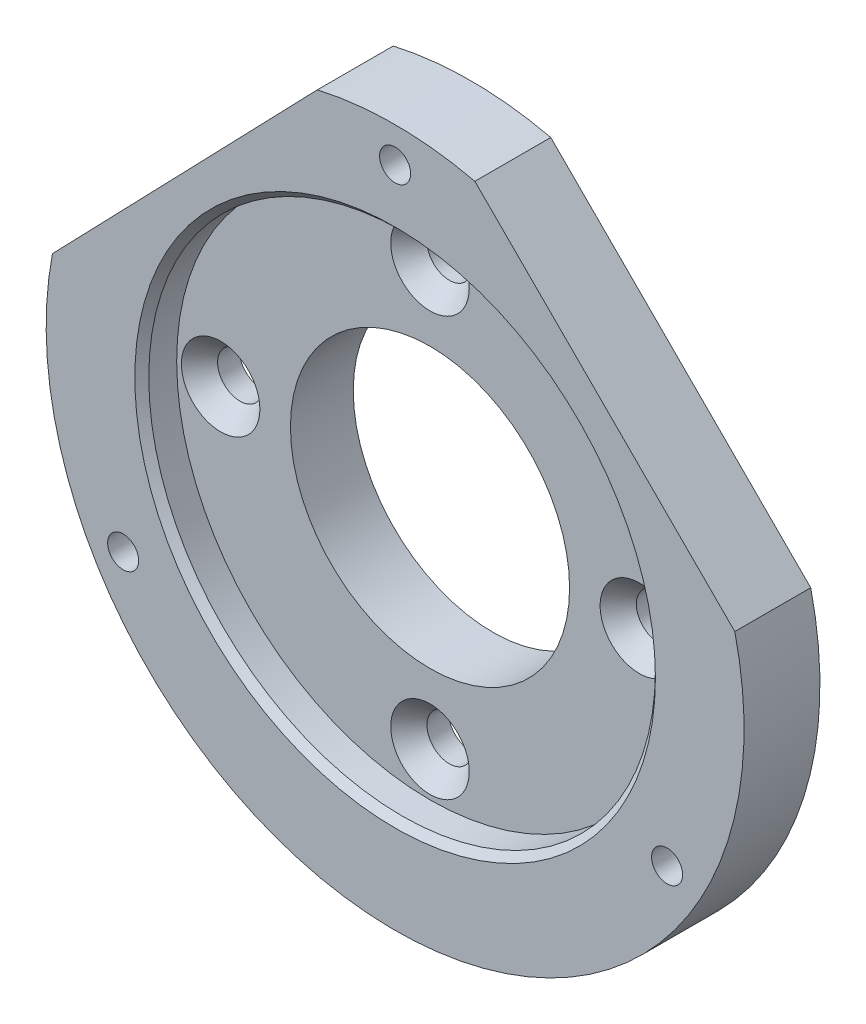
from build123d import *

# Parameters (mm, degrees)
SKETCH1_R                                      = 25.4
DISK_2OD_DEPTH                                 = 7.112
SKETCH3_R                                      = 10.16
THRU_HOLE_DEPTH                                = 37.618308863
SKETCH7_R                                      = 18.4404
CBORE_FOR_MOTOR_FLANGE_DEPTH                   = 2.54
SKETCH6_R                                      = 1.1303
MOTOR_BCD_4_40TAPPED_DEPTH                     = 37.618308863
SKETCH2_OUTSIDE_W                              = 67.238
SKETCH2_OUTSIDE_H                              = 67.238
SKETCH2_OUTSIDE_R                              = 12.6746
LIP_DEPTH                                      = 1.5875
CSK_FOR_4_FLAT_HEAD_MACHINE_SCREW1_D           = 3.2639
CSK_FOR_4_FLAT_HEAD_MACHINE_SCREW1_CSINK_D     = 5.715
CSK_FOR_4_FLAT_HEAD_MACHINE_SCREW1_CSINK_ANGLE = 82
F_45_DEG_CUT_DEPTH                             = 37.618308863
CHAMFER1_SIZE                                  = 0.508
CHAMFER2_SIZE                                  = 0.254


with BuildPart() as part:
    # Sketch1 → disk_2od (new body)
    with BuildSketch(Plane.XY):
        Circle(SKETCH1_R)
    extrude(amount=DISK_2OD_DEPTH)

    # Sketch3 → thru_hole (cut, through all)
    with BuildSketch(Plane(origin=(0, 0, 0), x_dir=(-1, 0, 0), z_dir=(0, 0, -1))):
        Circle(SKETCH3_R)
    extrude(amount=-THRU_HOLE_DEPTH, mode=Mode.SUBTRACT)

    # Sketch7 → cbore_for_motor_flange (cut)
    with BuildSketch(Plane.XY.offset(7.112)):
        Circle(SKETCH7_R)
    extrude(amount=-CBORE_FOR_MOTOR_FLANGE_DEPTH, mode=Mode.SUBTRACT)

    # Sketch6 → motor_bcd_4-40tapped (cut, through all)
    with BuildSketch(Plane.XY.offset(7.112)):
        with Locations((19.797340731, -11.43)):
            Circle(SKETCH6_R)
        with Locations((-19.797340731, -11.43)):
            Circle(SKETCH6_R)
        with Locations((0, 22.86)):
            Circle(SKETCH6_R)
    extrude(amount=-MOTOR_BCD_4_40TAPPED_DEPTH, mode=Mode.SUBTRACT)

    # Sketch2 outside → lip (cut)
    with BuildSketch(Plane(origin=(0, 0, 0), x_dir=(-1, 0, 0), z_dir=(0, 0, -1))):
        Rectangle(SKETCH2_OUTSIDE_W, SKETCH2_OUTSIDE_H)
        Circle(SKETCH2_OUTSIDE_R, mode=Mode.SUBTRACT)
    extrude(amount=-LIP_DEPTH, mode=Mode.SUBTRACT)

    # CSK for _4 Flat Head Machine Screw1 (through all)
    with Locations(Plane(origin=(15.24, 0, 4.572), x_dir=(1, 0, 0), z_dir=(0, 0, 1))):
        with Locations((0, 0), (-15.24, 15.24), (-30.48, 0), (-15.24, -15.24)):
            CounterSinkHole(CSK_FOR_4_FLAT_HEAD_MACHINE_SCREW1_D / 2, CSK_FOR_4_FLAT_HEAD_MACHINE_SCREW1_CSINK_D / 2, counter_sink_angle=CSK_FOR_4_FLAT_HEAD_MACHINE_SCREW1_CSINK_ANGLE)

    # Sketch11 → 45_deg_cut (cut, through all)
    with BuildSketch(Plane.XY.offset(7.112)):
        Polygon((0.898025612, 29.6348452), (29.6348452, 0.898025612), (34.12497326, 5.388153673), (5.388153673, 34.12497326), align=None)
        Polygon((-33.76885908, 4.792915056), (-29.200695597, 0.382202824), (-0.97213731, 29.618449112), (-5.540300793, 34.029161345), align=None)
    extrude(amount=-F_45_DEG_CUT_DEPTH, mode=Mode.SUBTRACT)

    # Chamfer1
    chamfer1_edges = [part.edges().sort_by_distance(p)[0] for p in [
        (-18.4404, 0, 7.112),
    ]]
    chamfer(chamfer1_edges, length=CHAMFER1_SIZE)

    # Chamfer2
    chamfer2_edges = [part.edges().sort_by_distance(p)[0] for p in [
        (12.6746, 0, 0),
    ]]
    chamfer(chamfer2_edges, length=CHAMFER2_SIZE)


solid = part.part
